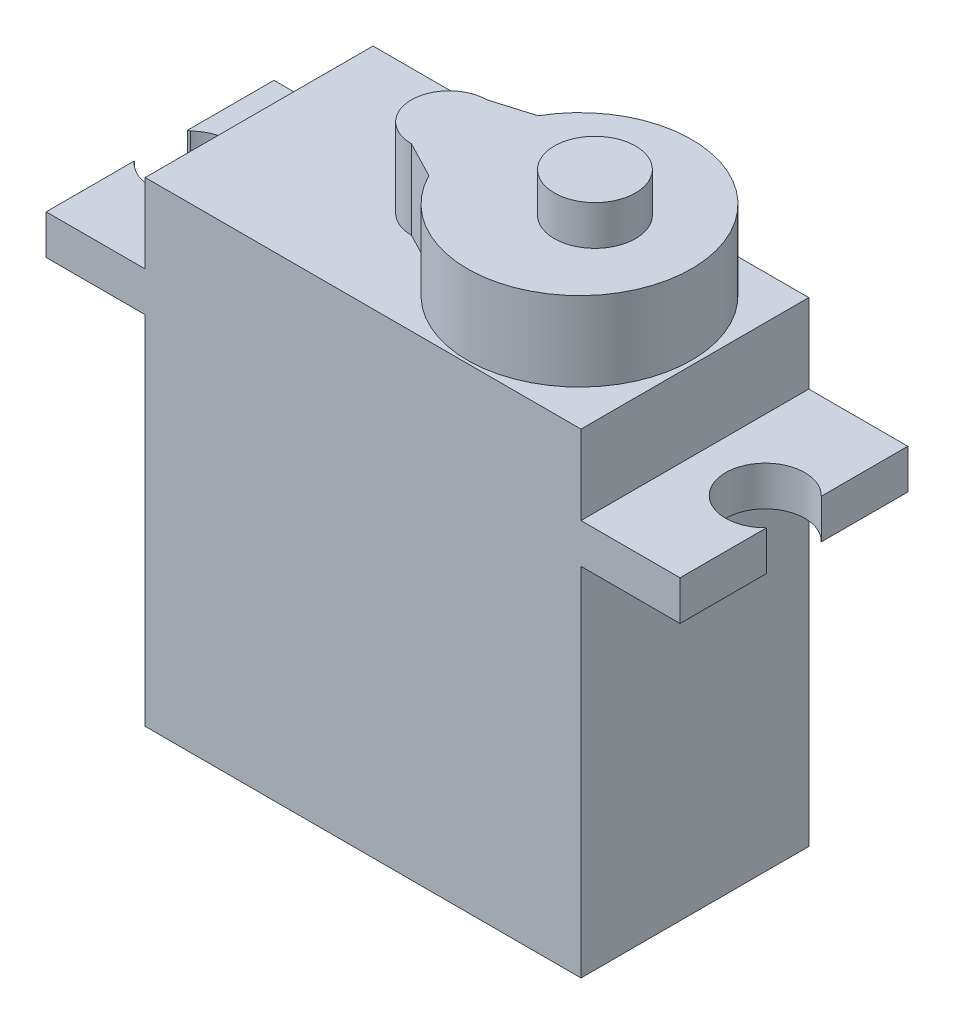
ISO-10303-21;
HEADER;
FILE_DESCRIPTION(('STEP AP214'),'2;1');
FILE_NAME('part.step','',(''),(''),'','','');
FILE_SCHEMA(('AUTOMOTIVE_DESIGN { 1 0 10303 214 1 1 1 1 }'));
ENDSEC;
DATA;
#1=APPLICATION_CONTEXT('core data for automotive mechanical design processes');
#2=APPLICATION_PROTOCOL_DEFINITION('international standard','automotive_design',2000,#1);
#3=PRODUCT_CONTEXT('',#1,'mechanical');
#4=PRODUCT('Part','Part','',(#3));
#5=PRODUCT_RELATED_PRODUCT_CATEGORY('part','',(#4));
#6=PRODUCT_DEFINITION_FORMATION('','',#4);
#7=PRODUCT_DEFINITION_CONTEXT('part definition',#1,'design');
#8=PRODUCT_DEFINITION('design','',#6,#7);
#9=PRODUCT_DEFINITION_SHAPE('','',#8);
#10=(LENGTH_UNIT() NAMED_UNIT(*) SI_UNIT(.MILLI.,.METRE.));
#11=(NAMED_UNIT(*) PLANE_ANGLE_UNIT() SI_UNIT($,.RADIAN.));
#12=(NAMED_UNIT(*) SI_UNIT($,.STERADIAN.) SOLID_ANGLE_UNIT());
#13=UNCERTAINTY_MEASURE_WITH_UNIT(LENGTH_MEASURE(1.E-05),#10,'distance_accuracy_value','');
#14=(GEOMETRIC_REPRESENTATION_CONTEXT(3) GLOBAL_UNCERTAINTY_ASSIGNED_CONTEXT((#13)) GLOBAL_UNIT_ASSIGNED_CONTEXT((#10,
#11,#12)) REPRESENTATION_CONTEXT('',''));
#15=CARTESIAN_POINT('',(0.,0.,0.));
#16=DIRECTION('',(0.,0.,1.));
#17=DIRECTION('',(1.,0.,0.));
#18=AXIS2_PLACEMENT_3D('',#15,#16,#17);
#19=CARTESIAN_POINT('',(11.8196202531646,0.,0.));
#20=DIRECTION('',(1.,0.,0.));
#21=DIRECTION('',(0.,0.,-1.));
#22=AXIS2_PLACEMENT_3D('',#19,#20,#21);
#23=PLANE('',#22);
#24=DIRECTION('',(0.,1.,0.));
#25=VECTOR('',#24,1.);
#26=CARTESIAN_POINT('',(11.8196202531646,13.,1.32376753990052));
#27=LINE('',#26,#25);
#28=CARTESIAN_POINT('',(11.8196202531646,18.,1.32376753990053));
#29=VERTEX_POINT('',#28);
#30=CARTESIAN_POINT('',(11.8196202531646,20.,1.32376753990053));
#31=VERTEX_POINT('',#30);
#32=EDGE_CURVE('E228',#29,#31,#27,.T.);
#33=ORIENTED_EDGE('',*,*,#32,.F.);
#34=DIRECTION('',(0.,0.,-1.));
#35=VECTOR('',#34,1.);
#36=CARTESIAN_POINT('',(11.8196202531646,18.,8.45411392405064));
#37=LINE('',#36,#35);
#38=CARTESIAN_POINT('',(11.8196202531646,18.,-3.04588607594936));
#39=VERTEX_POINT('',#38);
#40=EDGE_CURVE('E233',#29,#39,#37,.T.);
#41=ORIENTED_EDGE('',*,*,#40,.T.);
#42=DIRECTION('',(0.,1.,0.));
#43=VECTOR('',#42,1.);
#44=CARTESIAN_POINT('',(11.8196202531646,20.,-3.04588607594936));
#45=LINE('',#44,#43);
#46=CARTESIAN_POINT('',(11.8196202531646,20.,-3.04588607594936));
#47=VERTEX_POINT('',#46);
#48=EDGE_CURVE('E237',#39,#47,#45,.T.);
#49=ORIENTED_EDGE('',*,*,#48,.T.);
#50=DIRECTION('',(0.,0.,1.));
#51=VECTOR('',#50,1.);
#52=CARTESIAN_POINT('',(11.8196202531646,20.,8.45411392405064));
#53=LINE('',#52,#51);
#54=EDGE_CURVE('E241',#47,#31,#53,.T.);
#55=ORIENTED_EDGE('',*,*,#54,.T.);
#56=EDGE_LOOP('',(#33,#41,#49,#55));
#57=FACE_BOUND('',#56,.T.);
#58=ADVANCED_FACE('F45',(#57),#23,.T.);
#59=CARTESIAN_POINT('',(-20.1803797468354,0.,0.));
#60=DIRECTION('',(1.,0.,0.));
#61=DIRECTION('',(0.,0.,-1.));
#62=AXIS2_PLACEMENT_3D('',#59,#60,#61);
#63=PLANE('',#62);
#64=DIRECTION('',(0.,0.,1.));
#65=VECTOR('',#64,1.);
#66=CARTESIAN_POINT('',(-20.1803797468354,20.,8.45411392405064));
#67=LINE('',#66,#65);
#68=CARTESIAN_POINT('',(-20.1803797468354,20.,4.00851192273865));
#69=VERTEX_POINT('',#68);
#70=CARTESIAN_POINT('',(-20.1803797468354,20.,8.45411392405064));
#71=VERTEX_POINT('',#70);
#72=EDGE_CURVE('E254',#69,#71,#67,.T.);
#73=ORIENTED_EDGE('',*,*,#72,.F.);
#74=DIRECTION('',(0.,1.,0.));
#75=VECTOR('',#74,1.);
#76=CARTESIAN_POINT('',(-20.1803797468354,13.,4.00851192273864));
#77=LINE('',#76,#75);
#78=CARTESIAN_POINT('',(-20.1803797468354,18.,4.00851192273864));
#79=VERTEX_POINT('',#78);
#80=EDGE_CURVE('E54',#69,#79,#77,.F.);
#81=ORIENTED_EDGE('',*,*,#80,.T.);
#82=DIRECTION('',(0.,0.,-1.));
#83=VECTOR('',#82,1.);
#84=CARTESIAN_POINT('',(-20.1803797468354,18.,8.45411392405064));
#85=LINE('',#84,#83);
#86=CARTESIAN_POINT('',(-20.1803797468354,18.,8.45411392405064));
#87=VERTEX_POINT('',#86);
#88=EDGE_CURVE('E248',#87,#79,#85,.T.);
#89=ORIENTED_EDGE('',*,*,#88,.F.);
#90=DIRECTION('',(0.,-1.,0.));
#91=VECTOR('',#90,1.);
#92=CARTESIAN_POINT('',(-20.1803797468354,20.,8.45411392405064));
#93=LINE('',#92,#91);
#94=EDGE_CURVE('E244',#71,#87,#93,.T.);
#95=ORIENTED_EDGE('',*,*,#94,.F.);
#96=EDGE_LOOP('',(#73,#81,#89,#95));
#97=FACE_BOUND('',#96,.T.);
#98=ADVANCED_FACE('F328',(#97),#63,.F.);
#99=CARTESIAN_POINT('',(-15.1803797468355,24.,-3.04588607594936));
#100=DIRECTION('',(1.,0.,0.));
#101=DIRECTION('',(0.,0.,-1.));
#102=AXIS2_PLACEMENT_3D('',#99,#100,#101);
#103=PLANE('',#102);
#104=DIRECTION('',(0.,-1.,0.));
#105=VECTOR('',#104,1.);
#106=CARTESIAN_POINT('',(-15.1803797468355,24.,-3.04588607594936));
#107=LINE('',#106,#105);
#108=CARTESIAN_POINT('',(-15.1803797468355,24.,-3.04588607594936));
#109=VERTEX_POINT('',#108);
#110=CARTESIAN_POINT('',(-15.1803797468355,20.,-3.04588607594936));
#111=VERTEX_POINT('',#110);
#112=EDGE_CURVE('E306',#109,#111,#107,.T.);
#113=ORIENTED_EDGE('',*,*,#112,.T.);
#114=DIRECTION('',(0.,0.,1.));
#115=VECTOR('',#114,1.);
#116=CARTESIAN_POINT('',(-15.1803797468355,20.,-3.04588607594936));
#117=LINE('',#116,#115);
#118=CARTESIAN_POINT('',(-15.1803797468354,20.,8.45411392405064));
#119=VERTEX_POINT('',#118);
#120=EDGE_CURVE('E281',#111,#119,#117,.T.);
#121=ORIENTED_EDGE('',*,*,#120,.T.);
#122=DIRECTION('',(0.,-1.,0.));
#123=VECTOR('',#122,1.);
#124=CARTESIAN_POINT('',(-15.1803797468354,24.,8.45411392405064));
#125=LINE('',#124,#123);
#126=CARTESIAN_POINT('',(-15.1803797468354,24.,8.45411392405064));
#127=VERTEX_POINT('',#126);
#128=EDGE_CURVE('E318',#127,#119,#125,.T.);
#129=ORIENTED_EDGE('',*,*,#128,.F.);
#130=DIRECTION('',(0.,0.,1.));
#131=VECTOR('',#130,1.);
#132=CARTESIAN_POINT('',(-15.1803797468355,24.,-3.04588607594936));
#133=LINE('',#132,#131);
#134=EDGE_CURVE('E285',#109,#127,#133,.T.);
#135=ORIENTED_EDGE('',*,*,#134,.F.);
#136=EDGE_LOOP('',(#113,#121,#129,#135));
#137=FACE_BOUND('',#136,.T.);
#138=ADVANCED_FACE('F389',(#137),#103,.F.);
#139=CARTESIAN_POINT('',(6.81962025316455,24.,-3.04588607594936));
#140=DIRECTION('',(-1.,0.,0.));
#141=DIRECTION('',(0.,0.,1.));
#142=AXIS2_PLACEMENT_3D('',#139,#140,#141);
#143=PLANE('',#142);
#144=DIRECTION('',(0.,-1.,0.));
#145=VECTOR('',#144,1.);
#146=CARTESIAN_POINT('',(6.81962025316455,24.,8.45411392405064));
#147=LINE('',#146,#145);
#148=CARTESIAN_POINT('',(6.81962025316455,24.,8.45411392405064));
#149=VERTEX_POINT('',#148);
#150=CARTESIAN_POINT('',(6.81962025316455,20.,8.45411392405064));
#151=VERTEX_POINT('',#150);
#152=EDGE_CURVE('E314',#149,#151,#147,.T.);
#153=ORIENTED_EDGE('',*,*,#152,.T.);
#154=DIRECTION('',(0.,0.,-1.));
#155=VECTOR('',#154,1.);
#156=CARTESIAN_POINT('',(6.81962025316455,20.,-3.04588607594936));
#157=LINE('',#156,#155);
#158=CARTESIAN_POINT('',(6.81962025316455,20.,-3.04588607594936));
#159=VERTEX_POINT('',#158);
#160=EDGE_CURVE('E278',#151,#159,#157,.T.);
#161=ORIENTED_EDGE('',*,*,#160,.T.);
#162=DIRECTION('',(0.,-1.,0.));
#163=VECTOR('',#162,1.);
#164=CARTESIAN_POINT('',(6.81962025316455,24.,-3.04588607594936));
#165=LINE('',#164,#163);
#166=CARTESIAN_POINT('',(6.81962025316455,24.,-3.04588607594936));
#167=VERTEX_POINT('',#166);
#168=EDGE_CURVE('E310',#167,#159,#165,.T.);
#169=ORIENTED_EDGE('',*,*,#168,.F.);
#170=DIRECTION('',(0.,0.,-1.));
#171=VECTOR('',#170,1.);
#172=CARTESIAN_POINT('',(6.81962025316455,24.,-3.04588607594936));
#173=LINE('',#172,#171);
#174=EDGE_CURVE('E291',#149,#167,#173,.T.);
#175=ORIENTED_EDGE('',*,*,#174,.F.);
#176=EDGE_LOOP('',(#153,#161,#169,#175));
#177=FACE_BOUND('',#176,.T.);
#178=ADVANCED_FACE('F380',(#177),#143,.F.);
#179=CARTESIAN_POINT('',(-15.1803797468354,18.,8.45411392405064));
#180=VERTEX_POINT('',#179);
#181=CARTESIAN_POINT('',(-15.1803797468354,0.,8.45411392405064));
#182=VERTEX_POINT('',#181);
#183=EDGE_CURVE('E317',#180,#182,#125,.T.);
#184=ORIENTED_EDGE('',*,*,#183,.F.);
#185=DIRECTION('',(0.,0.,-1.));
#186=VECTOR('',#185,1.);
#187=CARTESIAN_POINT('',(-15.1803797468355,18.,-3.04588607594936));
#188=LINE('',#187,#186);
#189=CARTESIAN_POINT('',(-15.1803797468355,18.,-3.04588607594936));
#190=VERTEX_POINT('',#189);
#191=EDGE_CURVE('E275',#180,#190,#188,.T.);
#192=ORIENTED_EDGE('',*,*,#191,.T.);
#193=CARTESIAN_POINT('',(-15.1803797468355,0.,-3.04588607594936));
#194=VERTEX_POINT('',#193);
#195=EDGE_CURVE('E295',#190,#194,#107,.T.);
#196=ORIENTED_EDGE('',*,*,#195,.T.);
#197=DIRECTION('',(0.,0.,1.));
#198=VECTOR('',#197,1.);
#199=CARTESIAN_POINT('',(-15.1803797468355,0.,-3.04588607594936));
#200=LINE('',#199,#198);
#201=EDGE_CURVE('E284',#194,#182,#200,.T.);
#202=ORIENTED_EDGE('',*,*,#201,.T.);
#203=EDGE_LOOP('',(#184,#192,#196,#202));
#204=FACE_BOUND('',#203,.T.);
#205=ADVANCED_FACE('F47',(#204),#103,.F.);
#206=CARTESIAN_POINT('',(-15.1803797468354,24.,8.45411392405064));
#207=DIRECTION('',(0.,0.,-1.));
#208=DIRECTION('',(-1.,0.,0.));
#209=AXIS2_PLACEMENT_3D('',#206,#207,#208);
#210=PLANE('',#209);
#211=CARTESIAN_POINT('',(6.81962025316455,18.,8.45411392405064));
#212=VERTEX_POINT('',#211);
#213=CARTESIAN_POINT('',(6.81962025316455,0.,8.45411392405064));
#214=VERTEX_POINT('',#213);
#215=EDGE_CURVE('E313',#212,#214,#147,.T.);
#216=ORIENTED_EDGE('',*,*,#215,.F.);
#217=DIRECTION('',(1.,0.,0.));
#218=VECTOR('',#217,1.);
#219=CARTESIAN_POINT('',(-20.1803797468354,18.,8.45411392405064));
#220=LINE('',#219,#218);
#221=CARTESIAN_POINT('',(11.8196202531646,18.,8.45411392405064));
#222=VERTEX_POINT('',#221);
#223=EDGE_CURVE('E258',#212,#222,#220,.T.);
#224=ORIENTED_EDGE('',*,*,#223,.T.);
#225=DIRECTION('',(0.,-1.,0.));
#226=VECTOR('',#225,1.);
#227=CARTESIAN_POINT('',(11.8196202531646,20.,8.45411392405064));
#228=LINE('',#227,#226);
#229=CARTESIAN_POINT('',(11.8196202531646,20.,8.45411392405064));
#230=VERTEX_POINT('',#229);
#231=EDGE_CURVE('E230',#230,#222,#228,.T.);
#232=ORIENTED_EDGE('',*,*,#231,.F.);
#233=DIRECTION('',(1.,0.,0.));
#234=VECTOR('',#233,1.);
#235=CARTESIAN_POINT('',(-20.1803797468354,20.,8.45411392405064));
#236=LINE('',#235,#234);
#237=EDGE_CURVE('E262',#151,#230,#236,.T.);
#238=ORIENTED_EDGE('',*,*,#237,.F.);
#239=ORIENTED_EDGE('',*,*,#152,.F.);
#240=DIRECTION('',(1.,0.,0.));
#241=VECTOR('',#240,1.);
#242=CARTESIAN_POINT('',(-15.1803797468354,24.,8.45411392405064));
#243=LINE('',#242,#241);
#244=EDGE_CURVE('E288',#127,#149,#243,.T.);
#245=ORIENTED_EDGE('',*,*,#244,.F.);
#246=ORIENTED_EDGE('',*,*,#128,.T.);
#247=EDGE_CURVE('E259',#71,#119,#236,.T.);
#248=ORIENTED_EDGE('',*,*,#247,.F.);
#249=ORIENTED_EDGE('',*,*,#94,.T.);
#250=EDGE_CURVE('E270',#87,#180,#220,.T.);
#251=ORIENTED_EDGE('',*,*,#250,.T.);
#252=ORIENTED_EDGE('',*,*,#183,.T.);
#253=DIRECTION('',(1.,0.,0.));
#254=VECTOR('',#253,1.);
#255=CARTESIAN_POINT('',(-15.1803797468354,0.,8.45411392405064));
#256=LINE('',#255,#254);
#257=EDGE_CURVE('E298',#182,#214,#256,.T.);
#258=ORIENTED_EDGE('',*,*,#257,.T.);
#259=EDGE_LOOP('',(#216,#224,#232,#238,#239,#245,#246,#248,#249,#251,#252,#258));
#260=FACE_BOUND('',#259,.T.);
#261=ADVANCED_FACE('F339',(#260),#210,.F.);
#262=CARTESIAN_POINT('',(6.81962025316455,18.,-3.04588607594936));
#263=VERTEX_POINT('',#262);
#264=CARTESIAN_POINT('',(6.81962025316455,0.,-3.04588607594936));
#265=VERTEX_POINT('',#264);
#266=EDGE_CURVE('E309',#263,#265,#165,.T.);
#267=ORIENTED_EDGE('',*,*,#266,.F.);
#268=DIRECTION('',(0.,0.,1.));
#269=VECTOR('',#268,1.);
#270=CARTESIAN_POINT('',(6.81962025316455,18.,-3.04588607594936));
#271=LINE('',#270,#269);
#272=EDGE_CURVE('E261',#263,#212,#271,.T.);
#273=ORIENTED_EDGE('',*,*,#272,.T.);
#274=ORIENTED_EDGE('',*,*,#215,.T.);
#275=DIRECTION('',(0.,0.,-1.));
#276=VECTOR('',#275,1.);
#277=CARTESIAN_POINT('',(6.81962025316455,0.,-3.04588607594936));
#278=LINE('',#277,#276);
#279=EDGE_CURVE('E301',#214,#265,#278,.T.);
#280=ORIENTED_EDGE('',*,*,#279,.T.);
#281=EDGE_LOOP('',(#267,#273,#274,#280));
#282=FACE_BOUND('',#281,.T.);
#283=ADVANCED_FACE('F353',(#282),#143,.F.);
#284=CARTESIAN_POINT('',(-15.1803797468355,24.,-3.04588607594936));
#285=DIRECTION('',(0.,0.,1.));
#286=DIRECTION('',(1.,0.,0.));
#287=AXIS2_PLACEMENT_3D('',#284,#285,#286);
#288=PLANE('',#287);
#289=ORIENTED_EDGE('',*,*,#195,.F.);
#290=DIRECTION('',(1.,0.,0.));
#291=VECTOR('',#290,1.);
#292=CARTESIAN_POINT('',(-20.1803797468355,18.,-3.04588607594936));
#293=LINE('',#292,#291);
#294=CARTESIAN_POINT('',(-20.1803797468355,18.,-3.04588607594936));
#295=VERTEX_POINT('',#294);
#296=EDGE_CURVE('E267',#295,#190,#293,.T.);
#297=ORIENTED_EDGE('',*,*,#296,.F.);
#298=DIRECTION('',(0.,1.,0.));
#299=VECTOR('',#298,1.);
#300=CARTESIAN_POINT('',(-20.1803797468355,20.,-3.04588607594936));
#301=LINE('',#300,#299);
#302=CARTESIAN_POINT('',(-20.1803797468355,20.,-3.04588607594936));
#303=VERTEX_POINT('',#302);
#304=EDGE_CURVE('E251',#295,#303,#301,.T.);
#305=ORIENTED_EDGE('',*,*,#304,.T.);
#306=DIRECTION('',(1.,0.,0.));
#307=VECTOR('',#306,1.);
#308=CARTESIAN_POINT('',(-20.1803797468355,20.,-3.04588607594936));
#309=LINE('',#308,#307);
#310=EDGE_CURVE('E263',#303,#111,#309,.T.);
#311=ORIENTED_EDGE('',*,*,#310,.T.);
#312=ORIENTED_EDGE('',*,*,#112,.F.);
#313=DIRECTION('',(-1.,0.,0.));
#314=VECTOR('',#313,1.);
#315=CARTESIAN_POINT('',(-15.1803797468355,24.,-3.04588607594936));
#316=LINE('',#315,#314);
#317=EDGE_CURVE('E293',#167,#109,#316,.T.);
#318=ORIENTED_EDGE('',*,*,#317,.F.);
#319=ORIENTED_EDGE('',*,*,#168,.T.);
#320=EDGE_CURVE('E266',#159,#47,#309,.T.);
#321=ORIENTED_EDGE('',*,*,#320,.T.);
#322=ORIENTED_EDGE('',*,*,#48,.F.);
#323=EDGE_CURVE('E269',#263,#39,#293,.T.);
#324=ORIENTED_EDGE('',*,*,#323,.F.);
#325=ORIENTED_EDGE('',*,*,#266,.T.);
#326=DIRECTION('',(-1.,0.,0.));
#327=VECTOR('',#326,1.);
#328=CARTESIAN_POINT('',(-15.1803797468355,0.,-3.04588607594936));
#329=LINE('',#328,#327);
#330=EDGE_CURVE('E289',#265,#194,#329,.T.);
#331=ORIENTED_EDGE('',*,*,#330,.T.);
#332=EDGE_LOOP('',(#289,#297,#305,#311,#312,#318,#319,#321,#322,#324,#325,#331));
#333=FACE_BOUND('',#332,.T.);
#334=ADVANCED_FACE('F362',(#333),#288,.F.);
#335=CARTESIAN_POINT('',(0.,24.,0.));
#336=DIRECTION('',(0.,1.,0.));
#337=DIRECTION('',(0.,0.,1.));
#338=AXIS2_PLACEMENT_3D('',#335,#336,#337);
#339=PLANE('',#338);
#340=CARTESIAN_POINT('',(-5.94320206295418,24.,2.34221829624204));
#341=DIRECTION('',(0.,1.,0.));
#342=DIRECTION('',(0.,0.,1.));
#343=AXIS2_PLACEMENT_3D('',#340,#341,#342);
#344=CIRCLE('',#343,1.91420390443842);
#345=CARTESIAN_POINT('',(-5.94320206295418,24.,0.428014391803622));
#346=VERTEX_POINT('',#345);
#347=CARTESIAN_POINT('',(-5.94320206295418,24.,4.25642220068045));
#348=VERTEX_POINT('',#347);
#349=EDGE_CURVE('E61',#346,#348,#344,.T.);
#350=ORIENTED_EDGE('',*,*,#349,.F.);
#351=DIRECTION('',(-0.957863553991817,0.,0.287223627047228));
#352=VECTOR('',#351,1.);
#353=CARTESIAN_POINT('',(-5.94320206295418,24.,0.428014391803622));
#354=LINE('',#353,#352);
#355=CARTESIAN_POINT('',(-3.95984217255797,24.,-0.166713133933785));
#356=VERTEX_POINT('',#355);
#357=EDGE_CURVE('E65',#356,#346,#354,.T.);
#358=ORIENTED_EDGE('',*,*,#357,.F.);
#359=CARTESIAN_POINT('',(0.945459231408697,24.,2.65449162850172));
#360=DIRECTION('',(0.,1.,0.));
#361=DIRECTION('',(0.,0.,1.));
#362=AXIS2_PLACEMENT_3D('',#359,#360,#361);
#363=CIRCLE('',#362,5.65872584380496);
#364=CARTESIAN_POINT('',(-4.1027199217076,24.,5.21126017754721));
#365=VERTEX_POINT('',#364);
#366=EDGE_CURVE('E622',#365,#356,#363,.T.);
#367=ORIENTED_EDGE('',*,*,#366,.F.);
#368=DIRECTION('',(0.887653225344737,0.,0.460512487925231));
#369=VECTOR('',#368,1.);
#370=CARTESIAN_POINT('',(-5.94320206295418,24.,4.25642220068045));
#371=LINE('',#370,#369);
#372=EDGE_CURVE('E620',#348,#365,#371,.T.);
#373=ORIENTED_EDGE('',*,*,#372,.F.);
#374=EDGE_LOOP('',(#350,#358,#367,#373));
#375=FACE_BOUND('',#374,.T.);
#376=ORIENTED_EDGE('',*,*,#134,.T.);
#377=ORIENTED_EDGE('',*,*,#244,.T.);
#378=ORIENTED_EDGE('',*,*,#174,.T.);
#379=ORIENTED_EDGE('',*,*,#317,.T.);
#380=EDGE_LOOP('',(#376,#377,#378,#379));
#381=FACE_BOUND('',#380,.T.);
#382=ADVANCED_FACE('F384',(#375,#381),#339,.T.);
#383=CARTESIAN_POINT('',(0.,0.,0.));
#384=DIRECTION('',(0.,1.,0.));
#385=DIRECTION('',(0.,0.,1.));
#386=AXIS2_PLACEMENT_3D('',#383,#384,#385);
#387=PLANE('',#386);
#388=ORIENTED_EDGE('',*,*,#201,.F.);
#389=ORIENTED_EDGE('',*,*,#330,.F.);
#390=ORIENTED_EDGE('',*,*,#279,.F.);
#391=ORIENTED_EDGE('',*,*,#257,.F.);
#392=EDGE_LOOP('',(#388,#389,#390,#391));
#393=FACE_BOUND('',#392,.T.);
#394=ADVANCED_FACE('F347',(#393),#387,.F.);
#395=DIRECTION('',(0.,1.,0.));
#396=VECTOR('',#395,1.);
#397=CARTESIAN_POINT('',(11.8196202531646,13.,4.08446030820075));
#398=LINE('',#397,#396);
#399=CARTESIAN_POINT('',(11.8196202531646,20.,4.08446030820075));
#400=VERTEX_POINT('',#399);
#401=CARTESIAN_POINT('',(11.8196202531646,18.,4.08446030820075));
#402=VERTEX_POINT('',#401);
#403=EDGE_CURVE('E226',#400,#402,#398,.F.);
#404=ORIENTED_EDGE('',*,*,#403,.F.);
#405=EDGE_CURVE('E240',#400,#230,#53,.T.);
#406=ORIENTED_EDGE('',*,*,#405,.T.);
#407=ORIENTED_EDGE('',*,*,#231,.T.);
#408=EDGE_CURVE('E234',#222,#402,#37,.T.);
#409=ORIENTED_EDGE('',*,*,#408,.T.);
#410=EDGE_LOOP('',(#404,#406,#407,#409));
#411=FACE_BOUND('',#410,.T.);
#412=ADVANCED_FACE('F375',(#411),#23,.T.);
#413=CARTESIAN_POINT('',(-20.1803797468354,18.,8.45411392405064));
#414=DIRECTION('',(0.,-1.,0.));
#415=DIRECTION('',(0.,0.,-1.));
#416=AXIS2_PLACEMENT_3D('',#413,#414,#415);
#417=PLANE('',#416);
#418=CARTESIAN_POINT('',(10.3723318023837,18.,2.70411392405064));
#419=DIRECTION('',(0.,-1.,0.));
#420=DIRECTION('',(0.,0.,-1.));
#421=AXIS2_PLACEMENT_3D('',#418,#419,#420);
#422=CIRCLE('',#421,2.);
#423=EDGE_CURVE('E224',#402,#29,#422,.T.);
#424=ORIENTED_EDGE('',*,*,#423,.F.);
#425=ORIENTED_EDGE('',*,*,#408,.F.);
#426=ORIENTED_EDGE('',*,*,#223,.F.);
#427=ORIENTED_EDGE('',*,*,#272,.F.);
#428=ORIENTED_EDGE('',*,*,#323,.T.);
#429=ORIENTED_EDGE('',*,*,#40,.F.);
#430=EDGE_LOOP('',(#424,#425,#426,#427,#428,#429));
#431=FACE_BOUND('',#430,.T.);
#432=ADVANCED_FACE('F358',(#431),#417,.T.);
#433=CARTESIAN_POINT('',(-20.1803797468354,20.,8.45411392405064));
#434=DIRECTION('',(0.,1.,0.));
#435=DIRECTION('',(0.,0.,1.));
#436=AXIS2_PLACEMENT_3D('',#433,#434,#435);
#437=PLANE('',#436);
#438=CARTESIAN_POINT('',(10.3723318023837,20.,2.70411392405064));
#439=DIRECTION('',(0.,1.,0.));
#440=DIRECTION('',(0.,0.,1.));
#441=AXIS2_PLACEMENT_3D('',#438,#439,#440);
#442=CIRCLE('',#441,2.);
#443=EDGE_CURVE('E13',#31,#400,#442,.T.);
#444=ORIENTED_EDGE('',*,*,#443,.F.);
#445=ORIENTED_EDGE('',*,*,#54,.F.);
#446=ORIENTED_EDGE('',*,*,#320,.F.);
#447=ORIENTED_EDGE('',*,*,#160,.F.);
#448=ORIENTED_EDGE('',*,*,#237,.T.);
#449=ORIENTED_EDGE('',*,*,#405,.F.);
#450=EDGE_LOOP('',(#444,#445,#446,#447,#448,#449));
#451=FACE_BOUND('',#450,.T.);
#452=ADVANCED_FACE('F368',(#451),#437,.T.);
#453=CARTESIAN_POINT('',(-18.6642841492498,20.,2.70411392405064));
#454=DIRECTION('',(0.,1.,0.));
#455=DIRECTION('',(0.,0.,1.));
#456=AXIS2_PLACEMENT_3D('',#453,#454,#455);
#457=CIRCLE('',#456,2.);
#458=CARTESIAN_POINT('',(-20.0643459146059,20.,1.27588878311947));
#459=VERTEX_POINT('',#458);
#460=EDGE_CURVE('E208',#69,#459,#457,.T.);
#461=ORIENTED_EDGE('',*,*,#460,.F.);
#462=ORIENTED_EDGE('',*,*,#72,.T.);
#463=ORIENTED_EDGE('',*,*,#247,.T.);
#464=ORIENTED_EDGE('',*,*,#120,.F.);
#465=ORIENTED_EDGE('',*,*,#310,.F.);
#466=CARTESIAN_POINT('',(-20.1803797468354,20.,1.32073520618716));
#467=VERTEX_POINT('',#466);
#468=EDGE_CURVE('E255',#303,#467,#67,.T.);
#469=ORIENTED_EDGE('',*,*,#468,.T.);
#470=DIRECTION('',(-0.932757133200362,0.,0.360505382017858));
#471=VECTOR('',#470,1.);
#472=CARTESIAN_POINT('',(-20.0643459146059,20.,1.27588878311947));
#473=LINE('',#472,#471);
#474=EDGE_CURVE('E211',#459,#467,#473,.T.);
#475=ORIENTED_EDGE('',*,*,#474,.F.);
#476=EDGE_LOOP('',(#461,#462,#463,#464,#465,#469,#475));
#477=FACE_BOUND('',#476,.T.);
#478=ADVANCED_FACE('F391',(#477),#437,.T.);
#479=CARTESIAN_POINT('',(-18.6642841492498,18.,2.70411392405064));
#480=DIRECTION('',(0.,-1.,0.));
#481=DIRECTION('',(0.,0.,-1.));
#482=AXIS2_PLACEMENT_3D('',#479,#480,#481);
#483=CIRCLE('',#482,2.);
#484=CARTESIAN_POINT('',(-20.0643459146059,18.,1.27588878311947));
#485=VERTEX_POINT('',#484);
#486=EDGE_CURVE('E222',#485,#79,#483,.T.);
#487=ORIENTED_EDGE('',*,*,#486,.F.);
#488=DIRECTION('',(0.932757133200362,0.,-0.360505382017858));
#489=VECTOR('',#488,1.);
#490=CARTESIAN_POINT('',(-22.5790779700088,18.,2.24781856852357));
#491=LINE('',#490,#489);
#492=CARTESIAN_POINT('',(-20.1803797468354,18.,1.32073520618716));
#493=VERTEX_POINT('',#492);
#494=EDGE_CURVE('E220',#493,#485,#491,.T.);
#495=ORIENTED_EDGE('',*,*,#494,.F.);
#496=EDGE_CURVE('E247',#493,#295,#85,.T.);
#497=ORIENTED_EDGE('',*,*,#496,.T.);
#498=ORIENTED_EDGE('',*,*,#296,.T.);
#499=ORIENTED_EDGE('',*,*,#191,.F.);
#500=ORIENTED_EDGE('',*,*,#250,.F.);
#501=ORIENTED_EDGE('',*,*,#88,.T.);
#502=EDGE_LOOP('',(#487,#495,#497,#498,#499,#500,#501));
#503=FACE_BOUND('',#502,.T.);
#504=ADVANCED_FACE('F334',(#503),#417,.T.);
#505=ORIENTED_EDGE('',*,*,#496,.F.);
#506=DIRECTION('',(0.,1.,0.));
#507=VECTOR('',#506,1.);
#508=CARTESIAN_POINT('',(-20.1803797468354,0.,1.32073520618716));
#509=LINE('',#508,#507);
#510=EDGE_CURVE('E321',#493,#467,#509,.T.);
#511=ORIENTED_EDGE('',*,*,#510,.T.);
#512=ORIENTED_EDGE('',*,*,#468,.F.);
#513=ORIENTED_EDGE('',*,*,#304,.F.);
#514=EDGE_LOOP('',(#505,#511,#512,#513));
#515=FACE_BOUND('',#514,.T.);
#516=ADVANCED_FACE('F397',(#515),#63,.F.);
#517=CARTESIAN_POINT('',(-18.6642841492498,13.,2.70411392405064));
#518=DIRECTION('',(0.,1.,0.));
#519=DIRECTION('',(0.,0.,1.));
#520=AXIS2_PLACEMENT_3D('',#517,#518,#519);
#521=CYLINDRICAL_SURFACE('',#520,2.);
#522=ORIENTED_EDGE('',*,*,#486,.T.);
#523=ORIENTED_EDGE('',*,*,#80,.F.);
#524=ORIENTED_EDGE('',*,*,#460,.T.);
#525=DIRECTION('',(0.,1.,0.));
#526=VECTOR('',#525,1.);
#527=CARTESIAN_POINT('',(-20.0643459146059,13.,1.27588878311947));
#528=LINE('',#527,#526);
#529=EDGE_CURVE('E218',#485,#459,#528,.T.);
#530=ORIENTED_EDGE('',*,*,#529,.F.);
#531=EDGE_LOOP('',(#522,#523,#524,#530));
#532=FACE_BOUND('',#531,.T.);
#533=ADVANCED_FACE('F402',(#532),#521,.F.);
#534=CARTESIAN_POINT('',(-20.0643459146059,13.,1.27588878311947));
#535=DIRECTION('',(-0.360505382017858,0.,-0.932757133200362));
#536=DIRECTION('',(-0.932757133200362,0.,0.360505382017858));
#537=AXIS2_PLACEMENT_3D('',#534,#535,#536);
#538=PLANE('',#537);
#539=ORIENTED_EDGE('',*,*,#494,.T.);
#540=ORIENTED_EDGE('',*,*,#529,.T.);
#541=ORIENTED_EDGE('',*,*,#474,.T.);
#542=ORIENTED_EDGE('',*,*,#510,.F.);
#543=EDGE_LOOP('',(#539,#540,#541,#542));
#544=FACE_BOUND('',#543,.T.);
#545=ADVANCED_FACE('F400',(#544),#538,.F.);
#546=CARTESIAN_POINT('',(10.3723318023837,13.,2.70411392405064));
#547=DIRECTION('',(0.,1.,0.));
#548=DIRECTION('',(0.,0.,1.));
#549=AXIS2_PLACEMENT_3D('',#546,#547,#548);
#550=CYLINDRICAL_SURFACE('',#549,2.);
#551=ORIENTED_EDGE('',*,*,#32,.T.);
#552=ORIENTED_EDGE('',*,*,#443,.T.);
#553=ORIENTED_EDGE('',*,*,#403,.T.);
#554=ORIENTED_EDGE('',*,*,#423,.T.);
#555=EDGE_LOOP('',(#551,#552,#553,#554));
#556=FACE_BOUND('',#555,.T.);
#557=ADVANCED_FACE('F373',(#556),#550,.F.);
#558=CARTESIAN_POINT('',(-5.94320206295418,28.,2.34221829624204));
#559=DIRECTION('',(0.,-1.,0.));
#560=DIRECTION('',(0.,0.,-1.));
#561=AXIS2_PLACEMENT_3D('',#558,#559,#560);
#562=CYLINDRICAL_SURFACE('',#561,1.91420390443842);
#563=ORIENTED_EDGE('',*,*,#349,.T.);
#564=DIRECTION('',(0.,-1.,0.));
#565=VECTOR('',#564,1.);
#566=CARTESIAN_POINT('',(-5.94320206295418,28.,4.25642220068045));
#567=LINE('',#566,#565);
#568=CARTESIAN_POINT('',(-5.94320206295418,28.,4.25642220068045));
#569=VERTEX_POINT('',#568);
#570=EDGE_CURVE('E191',#569,#348,#567,.T.);
#571=ORIENTED_EDGE('',*,*,#570,.F.);
#572=CARTESIAN_POINT('',(-5.94320206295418,28.,2.34221829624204));
#573=DIRECTION('',(0.,1.,0.));
#574=DIRECTION('',(0.,0.,1.));
#575=AXIS2_PLACEMENT_3D('',#572,#573,#574);
#576=CIRCLE('',#575,1.91420390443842);
#577=CARTESIAN_POINT('',(-5.94320206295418,28.,0.428014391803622));
#578=VERTEX_POINT('',#577);
#579=EDGE_CURVE('E197',#578,#569,#576,.T.);
#580=ORIENTED_EDGE('',*,*,#579,.F.);
#581=DIRECTION('',(0.,-1.,0.));
#582=VECTOR('',#581,1.);
#583=CARTESIAN_POINT('',(-5.94320206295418,28.,0.428014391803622));
#584=LINE('',#583,#582);
#585=EDGE_CURVE('E618',#578,#346,#584,.T.);
#586=ORIENTED_EDGE('',*,*,#585,.T.);
#587=EDGE_LOOP('',(#563,#571,#580,#586));
#588=FACE_BOUND('',#587,.T.);
#589=ADVANCED_FACE('F207',(#588),#562,.T.);
#590=CARTESIAN_POINT('',(-5.94320206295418,28.,4.25642220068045));
#591=DIRECTION('',(0.460512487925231,0.,-0.887653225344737));
#592=DIRECTION('',(-0.887653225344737,0.,-0.460512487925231));
#593=AXIS2_PLACEMENT_3D('',#590,#591,#592);
#594=PLANE('',#593);
#595=ORIENTED_EDGE('',*,*,#372,.T.);
#596=DIRECTION('',(0.,-1.,0.));
#597=VECTOR('',#596,1.);
#598=CARTESIAN_POINT('',(-4.1027199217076,28.,5.21126017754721));
#599=LINE('',#598,#597);
#600=CARTESIAN_POINT('',(-4.1027199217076,28.,5.21126017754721));
#601=VERTEX_POINT('',#600);
#602=EDGE_CURVE('E193',#601,#365,#599,.T.);
#603=ORIENTED_EDGE('',*,*,#602,.F.);
#604=DIRECTION('',(0.887653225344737,0.,0.460512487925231));
#605=VECTOR('',#604,1.);
#606=CARTESIAN_POINT('',(-5.94320206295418,28.,4.25642220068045));
#607=LINE('',#606,#605);
#608=EDGE_CURVE('E186',#569,#601,#607,.T.);
#609=ORIENTED_EDGE('',*,*,#608,.F.);
#610=ORIENTED_EDGE('',*,*,#570,.T.);
#611=EDGE_LOOP('',(#595,#603,#609,#610));
#612=FACE_BOUND('',#611,.T.);
#613=ADVANCED_FACE('F189',(#612),#594,.F.);
#614=CARTESIAN_POINT('',(0.945459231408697,28.,2.65449162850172));
#615=DIRECTION('',(0.,-1.,0.));
#616=DIRECTION('',(0.,0.,-1.));
#617=AXIS2_PLACEMENT_3D('',#614,#615,#616);
#618=CYLINDRICAL_SURFACE('',#617,5.65872584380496);
#619=ORIENTED_EDGE('',*,*,#366,.T.);
#620=DIRECTION('',(0.,-1.,0.));
#621=VECTOR('',#620,1.);
#622=CARTESIAN_POINT('',(-3.95984217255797,28.,-0.166713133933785));
#623=LINE('',#622,#621);
#624=CARTESIAN_POINT('',(-3.95984217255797,28.,-0.166713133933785));
#625=VERTEX_POINT('',#624);
#626=EDGE_CURVE('E213',#625,#356,#623,.T.);
#627=ORIENTED_EDGE('',*,*,#626,.F.);
#628=CARTESIAN_POINT('',(0.945459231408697,28.,2.65449162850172));
#629=DIRECTION('',(0.,1.,0.));
#630=DIRECTION('',(0.,0.,1.));
#631=AXIS2_PLACEMENT_3D('',#628,#629,#630);
#632=CIRCLE('',#631,5.65872584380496);
#633=EDGE_CURVE('E196',#601,#625,#632,.T.);
#634=ORIENTED_EDGE('',*,*,#633,.F.);
#635=ORIENTED_EDGE('',*,*,#602,.T.);
#636=EDGE_LOOP('',(#619,#627,#634,#635));
#637=FACE_BOUND('',#636,.T.);
#638=ADVANCED_FACE('F557',(#637),#618,.T.);
#639=CARTESIAN_POINT('',(-5.94320206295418,28.,0.428014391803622));
#640=DIRECTION('',(0.287223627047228,0.,0.957863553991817));
#641=DIRECTION('',(0.957863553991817,0.,-0.287223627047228));
#642=AXIS2_PLACEMENT_3D('',#639,#640,#641);
#643=PLANE('',#642);
#644=ORIENTED_EDGE('',*,*,#357,.T.);
#645=ORIENTED_EDGE('',*,*,#585,.F.);
#646=DIRECTION('',(-0.957863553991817,0.,0.287223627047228));
#647=VECTOR('',#646,1.);
#648=CARTESIAN_POINT('',(-5.94320206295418,28.,0.428014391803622));
#649=LINE('',#648,#647);
#650=EDGE_CURVE('E202',#625,#578,#649,.T.);
#651=ORIENTED_EDGE('',*,*,#650,.F.);
#652=ORIENTED_EDGE('',*,*,#626,.T.);
#653=EDGE_LOOP('',(#644,#645,#651,#652));
#654=FACE_BOUND('',#653,.T.);
#655=ADVANCED_FACE('F566',(#654),#643,.F.);
#656=CARTESIAN_POINT('',(-5.94320206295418,28.,2.34221829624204));
#657=DIRECTION('',(0.,1.,0.));
#658=DIRECTION('',(0.,0.,1.));
#659=AXIS2_PLACEMENT_3D('',#656,#657,#658);
#660=PLANE('',#659);
#661=CARTESIAN_POINT('',(1.81962025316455,28.,2.74969113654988));
#662=DIRECTION('',(0.,1.,0.));
#663=DIRECTION('',(0.,0.,1.));
#664=AXIS2_PLACEMENT_3D('',#661,#662,#663);
#665=CIRCLE('',#664,2.05131306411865);
#666=CARTESIAN_POINT('',(1.81962025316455,28.,4.80100420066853));
#667=VERTEX_POINT('',#666);
#668=EDGE_CURVE('E49',#667,#667,#665,.F.);
#669=ORIENTED_EDGE('',*,*,#668,.T.);
#670=EDGE_LOOP('',(#669));
#671=FACE_BOUND('',#670,.T.);
#672=ORIENTED_EDGE('',*,*,#579,.T.);
#673=ORIENTED_EDGE('',*,*,#608,.T.);
#674=ORIENTED_EDGE('',*,*,#633,.T.);
#675=ORIENTED_EDGE('',*,*,#650,.T.);
#676=EDGE_LOOP('',(#672,#673,#674,#675));
#677=FACE_BOUND('',#676,.T.);
#678=ADVANCED_FACE('F200',(#671,#677),#660,.T.);
#679=CARTESIAN_POINT('',(1.81962025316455,30.,2.74969113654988));
#680=DIRECTION('',(0.,-1.,0.));
#681=DIRECTION('',(0.,0.,-1.));
#682=AXIS2_PLACEMENT_3D('',#679,#680,#681);
#683=CYLINDRICAL_SURFACE('',#682,2.05131306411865);
#684=ORIENTED_EDGE('',*,*,#668,.F.);
#685=EDGE_LOOP('',(#684));
#686=FACE_BOUND('',#685,.T.);
#687=CARTESIAN_POINT('',(1.81962025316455,30.,2.74969113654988));
#688=DIRECTION('',(0.,1.,0.));
#689=DIRECTION('',(0.,0.,1.));
#690=AXIS2_PLACEMENT_3D('',#687,#688,#689);
#691=CIRCLE('',#690,2.05131306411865);
#692=CARTESIAN_POINT('',(1.81962025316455,30.,4.80100420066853));
#693=VERTEX_POINT('',#692);
#694=EDGE_CURVE('E611',#693,#693,#691,.T.);
#695=ORIENTED_EDGE('',*,*,#694,.F.);
#696=EDGE_LOOP('',(#695));
#697=FACE_BOUND('',#696,.T.);
#698=ADVANCED_FACE('F585',(#686,#697),#683,.T.);
#699=CARTESIAN_POINT('',(1.81962025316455,30.,2.74969113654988));
#700=DIRECTION('',(0.,1.,0.));
#701=DIRECTION('',(0.,0.,1.));
#702=AXIS2_PLACEMENT_3D('',#699,#700,#701);
#703=PLANE('',#702);
#704=ORIENTED_EDGE('',*,*,#694,.T.);
#705=EDGE_LOOP('',(#704));
#706=FACE_BOUND('',#705,.T.);
#707=ADVANCED_FACE('F595',(#706),#703,.T.);
#708=CLOSED_SHELL('',(#58,#98,#138,#178,#205,#261,#283,#334,#382,#394,#412,#432,#452,#478,#504,
#516,#533,#545,#557,#589,#613,#638,#655,#678,#698,#707));
#709=MANIFOLD_SOLID_BREP('B2',#708);
#710=ADVANCED_BREP_SHAPE_REPRESENTATION('',(#18,#709),#14);
#711=SHAPE_DEFINITION_REPRESENTATION(#9,#710);
ENDSEC;
END-ISO-10303-21;
